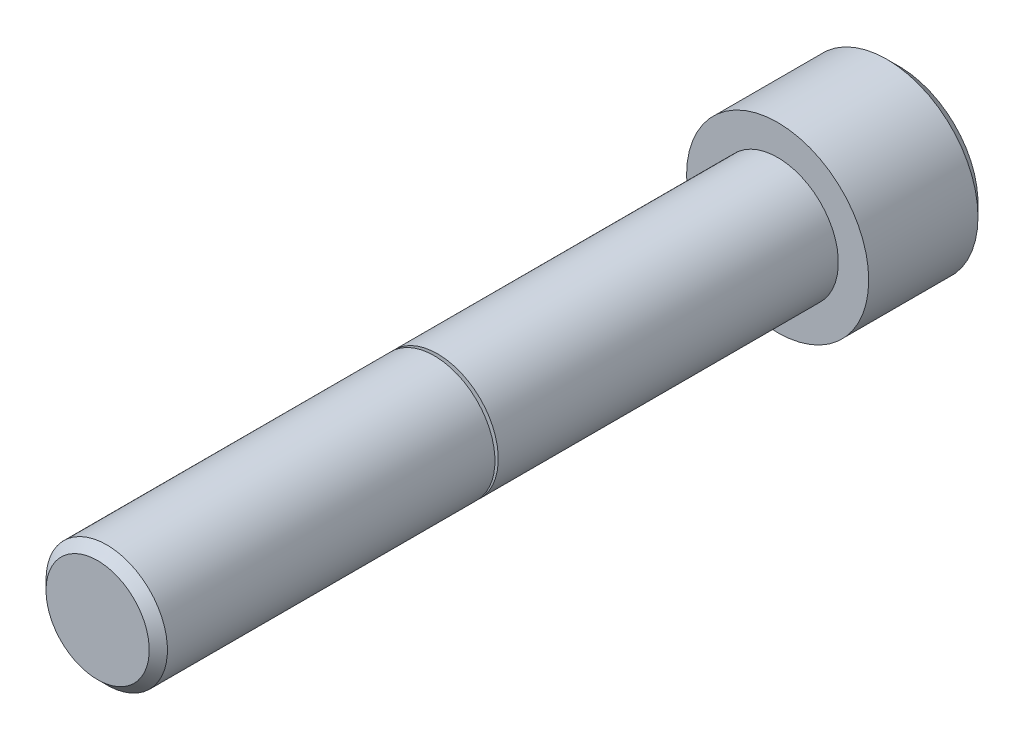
ISO-10303-21;
HEADER;
FILE_DESCRIPTION(('STEP AP214'),'2;1');
FILE_NAME('part.step','',(''),(''),'','','');
FILE_SCHEMA(('AUTOMOTIVE_DESIGN { 1 0 10303 214 1 1 1 1 }'));
ENDSEC;
DATA;
#1=APPLICATION_CONTEXT('core data for automotive mechanical design processes');
#2=APPLICATION_PROTOCOL_DEFINITION('international standard','automotive_design',2000,#1);
#3=PRODUCT_CONTEXT('',#1,'mechanical');
#4=PRODUCT('Part','Part','',(#3));
#5=PRODUCT_RELATED_PRODUCT_CATEGORY('part','',(#4));
#6=PRODUCT_DEFINITION_FORMATION('','',#4);
#7=PRODUCT_DEFINITION_CONTEXT('part definition',#1,'design');
#8=PRODUCT_DEFINITION('design','',#6,#7);
#9=PRODUCT_DEFINITION_SHAPE('','',#8);
#10=(LENGTH_UNIT() NAMED_UNIT(*) SI_UNIT(.MILLI.,.METRE.));
#11=(NAMED_UNIT(*) PLANE_ANGLE_UNIT() SI_UNIT($,.RADIAN.));
#12=(NAMED_UNIT(*) SI_UNIT($,.STERADIAN.) SOLID_ANGLE_UNIT());
#13=UNCERTAINTY_MEASURE_WITH_UNIT(LENGTH_MEASURE(1.E-05),#10,'distance_accuracy_value','');
#14=(GEOMETRIC_REPRESENTATION_CONTEXT(3) GLOBAL_UNCERTAINTY_ASSIGNED_CONTEXT((#13)) GLOBAL_UNIT_ASSIGNED_CONTEXT((#10,
#11,#12)) REPRESENTATION_CONTEXT('',''));
#15=CARTESIAN_POINT('',(0.,0.,0.));
#16=DIRECTION('',(0.,0.,1.));
#17=DIRECTION('',(1.,0.,0.));
#18=AXIS2_PLACEMENT_3D('',#15,#16,#17);
#19=CARTESIAN_POINT('',(0.,0.,-15.875));
#20=DIRECTION('',(0.,0.,1.));
#21=DIRECTION('',(1.,0.,0.));
#22=AXIS2_PLACEMENT_3D('',#19,#20,#21);
#23=PLANE('',#22);
#24=DIRECTION('',(-0.5,-0.866025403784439,0.));
#25=VECTOR('',#24,1.);
#26=CARTESIAN_POINT('',(7.33234841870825,0.,-15.875));
#27=LINE('',#26,#25);
#28=CARTESIAN_POINT('',(7.33234841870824,0.,-15.875));
#29=VERTEX_POINT('',#28);
#30=CARTESIAN_POINT('',(3.66617420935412,-6.35,-15.875));
#31=VERTEX_POINT('',#30);
#32=EDGE_CURVE('E147',#29,#31,#27,.T.);
#33=ORIENTED_EDGE('',*,*,#32,.F.);
#34=DIRECTION('',(0.5,-0.866025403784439,0.));
#35=VECTOR('',#34,1.);
#36=CARTESIAN_POINT('',(3.66617420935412,6.35,-15.875));
#37=LINE('',#36,#35);
#38=CARTESIAN_POINT('',(3.66617420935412,6.35,-15.875));
#39=VERTEX_POINT('',#38);
#40=EDGE_CURVE('E66',#39,#29,#37,.T.);
#41=ORIENTED_EDGE('',*,*,#40,.F.);
#42=DIRECTION('',(1.,0.,0.));
#43=VECTOR('',#42,1.);
#44=CARTESIAN_POINT('',(-3.66617420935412,6.35,-15.875));
#45=LINE('',#44,#43);
#46=CARTESIAN_POINT('',(-3.66617420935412,6.35,-15.875));
#47=VERTEX_POINT('',#46);
#48=EDGE_CURVE('E160',#47,#39,#45,.T.);
#49=ORIENTED_EDGE('',*,*,#48,.F.);
#50=DIRECTION('',(0.5,0.866025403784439,0.));
#51=VECTOR('',#50,1.);
#52=CARTESIAN_POINT('',(-7.33234841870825,0.,-15.875));
#53=LINE('',#52,#51);
#54=CARTESIAN_POINT('',(-7.33234841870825,0.,-15.875));
#55=VERTEX_POINT('',#54);
#56=EDGE_CURVE('E157',#55,#47,#53,.T.);
#57=ORIENTED_EDGE('',*,*,#56,.F.);
#58=DIRECTION('',(-0.5,0.866025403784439,0.));
#59=VECTOR('',#58,1.);
#60=CARTESIAN_POINT('',(-3.66617420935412,-6.35,-15.875));
#61=LINE('',#60,#59);
#62=CARTESIAN_POINT('',(-3.66617420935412,-6.35,-15.875));
#63=VERTEX_POINT('',#62);
#64=EDGE_CURVE('E114',#63,#55,#61,.T.);
#65=ORIENTED_EDGE('',*,*,#64,.F.);
#66=DIRECTION('',(-1.,0.,0.));
#67=VECTOR('',#66,1.);
#68=CARTESIAN_POINT('',(3.66617420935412,-6.35,-15.875));
#69=LINE('',#68,#67);
#70=EDGE_CURVE('E151',#31,#63,#69,.T.);
#71=ORIENTED_EDGE('',*,*,#70,.F.);
#72=EDGE_LOOP('',(#33,#41,#49,#57,#65,#71));
#73=FACE_BOUND('',#72,.T.);
#74=CARTESIAN_POINT('',(0.,0.,-15.875));
#75=DIRECTION('',(0.,0.,-1.));
#76=DIRECTION('',(-1.,0.,0.));
#77=AXIS2_PLACEMENT_3D('',#74,#75,#76);
#78=CIRCLE('',#77,10.31875);
#79=CARTESIAN_POINT('',(-10.31875,0.,-15.875));
#80=VERTEX_POINT('',#79);
#81=EDGE_CURVE('E166',#80,#80,#78,.T.);
#82=ORIENTED_EDGE('',*,*,#81,.T.);
#83=EDGE_LOOP('',(#82));
#84=FACE_BOUND('',#83,.T.);
#85=ADVANCED_FACE('F51',(#73,#84),#23,.F.);
#86=CARTESIAN_POINT('',(-6.74751000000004,0.,88.9));
#87=DIRECTION('',(0.,0.,-1.));
#88=DIRECTION('',(-1.,0.,0.));
#89=AXIS2_PLACEMENT_3D('',#86,#87,#88);
#90=PLANE('',#89);
#91=CARTESIAN_POINT('',(0.,0.,88.9));
#92=DIRECTION('',(0.,0.,-1.));
#93=DIRECTION('',(-1.,0.,0.));
#94=AXIS2_PLACEMENT_3D('',#91,#92,#93);
#95=CIRCLE('',#94,6.74751000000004);
#96=CARTESIAN_POINT('',(-6.74751000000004,0.,88.9));
#97=VERTEX_POINT('',#96);
#98=EDGE_CURVE('E11',#97,#97,#95,.T.);
#99=ORIENTED_EDGE('',*,*,#98,.F.);
#100=EDGE_LOOP('',(#99));
#101=FACE_BOUND('',#100,.T.);
#102=ADVANCED_FACE('F216',(#101),#90,.F.);
#103=CARTESIAN_POINT('',(0.,0.,88.9));
#104=DIRECTION('',(0.,0.,-1.));
#105=DIRECTION('',(-1.,0.,0.));
#106=AXIS2_PLACEMENT_3D('',#103,#104,#105);
#107=CONICAL_SURFACE('',#106,6.74751000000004,0.785398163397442);
#108=CARTESIAN_POINT('',(0.,0.,87.71001));
#109=DIRECTION('',(0.,0.,-1.));
#110=DIRECTION('',(-1.,0.,0.));
#111=AXIS2_PLACEMENT_3D('',#108,#109,#110);
#112=CIRCLE('',#111,7.93750000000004);
#113=CARTESIAN_POINT('',(-7.93750000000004,0.,87.71001));
#114=VERTEX_POINT('',#113);
#115=EDGE_CURVE('E59',#114,#114,#112,.T.);
#116=ORIENTED_EDGE('',*,*,#115,.F.);
#117=EDGE_LOOP('',(#116));
#118=FACE_BOUND('',#117,.T.);
#119=ORIENTED_EDGE('',*,*,#98,.T.);
#120=EDGE_LOOP('',(#119));
#121=FACE_BOUND('',#120,.T.);
#122=ADVANCED_FACE('F213',(#118,#121),#107,.T.);
#123=CARTESIAN_POINT('',(0.,0.,-10.585154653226));
#124=DIRECTION('',(0.,0.,-1.));
#125=DIRECTION('',(-1.,0.,0.));
#126=AXIS2_PLACEMENT_3D('',#123,#124,#125);
#127=CYLINDRICAL_SURFACE('',#126,7.93750000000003);
#128=CARTESIAN_POINT('',(0.,0.,44.8931209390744));
#129=DIRECTION('',(0.,0.,-1.));
#130=DIRECTION('',(-1.,0.,0.));
#131=AXIS2_PLACEMENT_3D('',#128,#129,#130);
#132=CIRCLE('',#131,7.93750000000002);
#133=CARTESIAN_POINT('',(-7.93750000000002,0.,44.8931209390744));
#134=VERTEX_POINT('',#133);
#135=EDGE_CURVE('E203',#134,#134,#132,.T.);
#136=ORIENTED_EDGE('',*,*,#135,.F.);
#137=EDGE_LOOP('',(#136));
#138=FACE_BOUND('',#137,.T.);
#139=ORIENTED_EDGE('',*,*,#115,.T.);
#140=EDGE_LOOP('',(#139));
#141=FACE_BOUND('',#140,.T.);
#142=ADVANCED_FACE('F211',(#138,#141),#127,.T.);
#143=CARTESIAN_POINT('',(0.,0.,44.8931209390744));
#144=DIRECTION('',(0.,0.,1.));
#145=DIRECTION('',(1.,0.,0.));
#146=AXIS2_PLACEMENT_3D('',#143,#144,#145);
#147=CONICAL_SURFACE('',#146,7.93750000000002,1.22173047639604);
#148=CARTESIAN_POINT('',(0.,0.,44.4987938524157));
#149=DIRECTION('',(0.,0.,-1.));
#150=DIRECTION('',(-1.,0.,0.));
#151=AXIS2_PLACEMENT_3D('',#148,#149,#150);
#152=CIRCLE('',#151,6.85409523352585);
#153=CARTESIAN_POINT('',(-6.85409523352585,0.,44.4987938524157));
#154=VERTEX_POINT('',#153);
#155=EDGE_CURVE('E199',#154,#154,#152,.T.);
#156=ORIENTED_EDGE('',*,*,#155,.F.);
#157=EDGE_LOOP('',(#156));
#158=FACE_BOUND('',#157,.T.);
#159=ORIENTED_EDGE('',*,*,#135,.T.);
#160=EDGE_LOOP('',(#159));
#161=FACE_BOUND('',#160,.T.);
#162=ADVANCED_FACE('F228',(#158,#161),#147,.T.);
#163=CARTESIAN_POINT('',(0.,0.,44.48));
#164=DIRECTION('',(0.,0.,-1.));
#165=DIRECTION('',(-1.,0.,0.));
#166=AXIS2_PLACEMENT_3D('',#163,#164,#165);
#167=TOROIDAL_SURFACE('',#166,6.86093563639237,0.0199999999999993);
#168=CARTESIAN_POINT('',(0.,0.,44.46));
#169=DIRECTION('',(0.,0.,-1.));
#170=DIRECTION('',(-1.,0.,0.));
#171=AXIS2_PLACEMENT_3D('',#168,#169,#170);
#172=CIRCLE('',#171,6.86093563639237);
#173=CARTESIAN_POINT('',(-6.86093563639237,0.,44.46));
#174=VERTEX_POINT('',#173);
#175=EDGE_CURVE('E195',#174,#174,#172,.T.);
#176=ORIENTED_EDGE('',*,*,#175,.F.);
#177=EDGE_LOOP('',(#176));
#178=FACE_BOUND('',#177,.T.);
#179=ORIENTED_EDGE('',*,*,#155,.T.);
#180=EDGE_LOOP('',(#179));
#181=FACE_BOUND('',#180,.T.);
#182=ADVANCED_FACE('F232',(#178,#181),#167,.F.);
#183=CARTESIAN_POINT('',(-7.93750000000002,0.,44.46));
#184=DIRECTION('',(0.,0.,-1.));
#185=DIRECTION('',(-1.,0.,0.));
#186=AXIS2_PLACEMENT_3D('',#183,#184,#185);
#187=PLANE('',#186);
#188=CARTESIAN_POINT('',(0.,0.,44.46));
#189=DIRECTION('',(0.,0.,-1.));
#190=DIRECTION('',(-1.,0.,0.));
#191=AXIS2_PLACEMENT_3D('',#188,#189,#190);
#192=CIRCLE('',#191,7.93750000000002);
#193=CARTESIAN_POINT('',(-7.93750000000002,0.,44.46));
#194=VERTEX_POINT('',#193);
#195=EDGE_CURVE('E191',#194,#194,#192,.T.);
#196=ORIENTED_EDGE('',*,*,#195,.F.);
#197=EDGE_LOOP('',(#196));
#198=FACE_BOUND('',#197,.T.);
#199=ORIENTED_EDGE('',*,*,#175,.T.);
#200=EDGE_LOOP('',(#199));
#201=FACE_BOUND('',#200,.T.);
#202=ADVANCED_FACE('F236',(#198,#201),#187,.F.);
#203=CARTESIAN_POINT('',(0.,0.,-10.585154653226));
#204=DIRECTION('',(0.,0.,-1.));
#205=DIRECTION('',(-1.,0.,0.));
#206=AXIS2_PLACEMENT_3D('',#203,#204,#205);
#207=CYLINDRICAL_SURFACE('',#206,7.93750000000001);
#208=CARTESIAN_POINT('',(0.,0.,0.));
#209=DIRECTION('',(0.,0.,-1.));
#210=DIRECTION('',(-1.,0.,0.));
#211=AXIS2_PLACEMENT_3D('',#208,#209,#210);
#212=CIRCLE('',#211,7.9375);
#213=CARTESIAN_POINT('',(-7.9375,0.,0.));
#214=VERTEX_POINT('',#213);
#215=EDGE_CURVE('E187',#214,#214,#212,.T.);
#216=ORIENTED_EDGE('',*,*,#215,.F.);
#217=EDGE_LOOP('',(#216));
#218=FACE_BOUND('',#217,.T.);
#219=ORIENTED_EDGE('',*,*,#195,.T.);
#220=EDGE_LOOP('',(#219));
#221=FACE_BOUND('',#220,.T.);
#222=ADVANCED_FACE('F240',(#218,#221),#207,.T.);
#223=CARTESIAN_POINT('',(-11.90625,0.,0.));
#224=DIRECTION('',(0.,0.,-1.));
#225=DIRECTION('',(-1.,0.,0.));
#226=AXIS2_PLACEMENT_3D('',#223,#224,#225);
#227=PLANE('',#226);
#228=CARTESIAN_POINT('',(0.,0.,0.));
#229=DIRECTION('',(0.,0.,-1.));
#230=DIRECTION('',(-1.,0.,0.));
#231=AXIS2_PLACEMENT_3D('',#228,#229,#230);
#232=CIRCLE('',#231,11.90625);
#233=CARTESIAN_POINT('',(-11.90625,0.,0.));
#234=VERTEX_POINT('',#233);
#235=EDGE_CURVE('E183',#234,#234,#232,.T.);
#236=ORIENTED_EDGE('',*,*,#235,.F.);
#237=EDGE_LOOP('',(#236));
#238=FACE_BOUND('',#237,.T.);
#239=ORIENTED_EDGE('',*,*,#215,.T.);
#240=EDGE_LOOP('',(#239));
#241=FACE_BOUND('',#240,.T.);
#242=ADVANCED_FACE('F244',(#238,#241),#227,.F.);
#243=CARTESIAN_POINT('',(0.,0.,-10.585154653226));
#244=DIRECTION('',(0.,0.,-1.));
#245=DIRECTION('',(-1.,0.,0.));
#246=AXIS2_PLACEMENT_3D('',#243,#244,#245);
#247=CYLINDRICAL_SURFACE('',#246,11.90625);
#248=CARTESIAN_POINT('',(0.,0.,-14.2875));
#249=DIRECTION('',(0.,0.,-1.));
#250=DIRECTION('',(-1.,0.,0.));
#251=AXIS2_PLACEMENT_3D('',#248,#249,#250);
#252=CIRCLE('',#251,11.90625);
#253=CARTESIAN_POINT('',(-11.90625,0.,-14.2875));
#254=VERTEX_POINT('',#253);
#255=EDGE_CURVE('E179',#254,#254,#252,.T.);
#256=ORIENTED_EDGE('',*,*,#255,.F.);
#257=EDGE_LOOP('',(#256));
#258=FACE_BOUND('',#257,.T.);
#259=ORIENTED_EDGE('',*,*,#235,.T.);
#260=EDGE_LOOP('',(#259));
#261=FACE_BOUND('',#260,.T.);
#262=ADVANCED_FACE('F248',(#258,#261),#247,.T.);
#263=CARTESIAN_POINT('',(0.,0.,-14.2875));
#264=DIRECTION('',(0.,0.,1.));
#265=DIRECTION('',(1.,0.,0.));
#266=AXIS2_PLACEMENT_3D('',#263,#264,#265);
#267=CONICAL_SURFACE('',#266,11.90625,0.785398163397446);
#268=ORIENTED_EDGE('',*,*,#81,.F.);
#269=EDGE_LOOP('',(#268));
#270=FACE_BOUND('',#269,.T.);
#271=ORIENTED_EDGE('',*,*,#255,.T.);
#272=EDGE_LOOP('',(#271));
#273=FACE_BOUND('',#272,.T.);
#274=ADVANCED_FACE('F252',(#270,#273),#267,.T.);
#275=CARTESIAN_POINT('',(3.66617420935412,6.35,-7.9375));
#276=DIRECTION('',(0.866025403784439,0.5,0.));
#277=DIRECTION('',(-0.5,0.866025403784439,0.));
#278=AXIS2_PLACEMENT_3D('',#275,#276,#277);
#279=PLANE('',#278);
#280=ORIENTED_EDGE('',*,*,#40,.T.);
#281=DIRECTION('',(0.,0.,-1.));
#282=VECTOR('',#281,1.);
#283=CARTESIAN_POINT('',(7.33234841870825,0.,-7.9375));
#284=LINE('',#283,#282);
#285=CARTESIAN_POINT('',(7.33234841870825,0.,-7.9375));
#286=VERTEX_POINT('',#285);
#287=EDGE_CURVE('E96',#286,#29,#284,.T.);
#288=ORIENTED_EDGE('',*,*,#287,.F.);
#289=DIRECTION('',(0.5,-0.866025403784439,0.));
#290=VECTOR('',#289,1.);
#291=CARTESIAN_POINT('',(3.66617420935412,6.35,-7.9375));
#292=LINE('',#291,#290);
#293=CARTESIAN_POINT('',(3.66617420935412,6.35,-7.9375));
#294=VERTEX_POINT('',#293);
#295=EDGE_CURVE('E163',#294,#286,#292,.T.);
#296=ORIENTED_EDGE('',*,*,#295,.F.);
#297=DIRECTION('',(0.,0.,-1.));
#298=VECTOR('',#297,1.);
#299=CARTESIAN_POINT('',(3.66617420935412,6.35,-7.9375));
#300=LINE('',#299,#298);
#301=EDGE_CURVE('E74',#294,#39,#300,.T.);
#302=ORIENTED_EDGE('',*,*,#301,.T.);
#303=EDGE_LOOP('',(#280,#288,#296,#302));
#304=FACE_BOUND('',#303,.T.);
#305=ADVANCED_FACE('F256',(#304),#279,.F.);
#306=CARTESIAN_POINT('',(-3.66617420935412,6.35,-7.9375));
#307=DIRECTION('',(0.,1.,0.));
#308=DIRECTION('',(-1.,0.,0.));
#309=AXIS2_PLACEMENT_3D('',#306,#307,#308);
#310=PLANE('',#309);
#311=ORIENTED_EDGE('',*,*,#48,.T.);
#312=ORIENTED_EDGE('',*,*,#301,.F.);
#313=DIRECTION('',(1.,0.,0.));
#314=VECTOR('',#313,1.);
#315=CARTESIAN_POINT('',(-3.66617420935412,6.35,-7.9375));
#316=LINE('',#315,#314);
#317=CARTESIAN_POINT('',(-3.66617420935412,6.35,-7.9375));
#318=VERTEX_POINT('',#317);
#319=EDGE_CURVE('E128',#318,#294,#316,.T.);
#320=ORIENTED_EDGE('',*,*,#319,.F.);
#321=DIRECTION('',(0.,0.,-1.));
#322=VECTOR('',#321,1.);
#323=CARTESIAN_POINT('',(-3.66617420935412,6.35,-7.9375));
#324=LINE('',#323,#322);
#325=EDGE_CURVE('E119',#318,#47,#324,.T.);
#326=ORIENTED_EDGE('',*,*,#325,.T.);
#327=EDGE_LOOP('',(#311,#312,#320,#326));
#328=FACE_BOUND('',#327,.T.);
#329=ADVANCED_FACE('F260',(#328),#310,.F.);
#330=CARTESIAN_POINT('',(-7.33234841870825,0.,-7.9375));
#331=DIRECTION('',(-0.866025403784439,0.5,0.));
#332=DIRECTION('',(-0.5,-0.866025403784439,0.));
#333=AXIS2_PLACEMENT_3D('',#330,#331,#332);
#334=PLANE('',#333);
#335=ORIENTED_EDGE('',*,*,#56,.T.);
#336=ORIENTED_EDGE('',*,*,#325,.F.);
#337=DIRECTION('',(0.5,0.866025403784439,0.));
#338=VECTOR('',#337,1.);
#339=CARTESIAN_POINT('',(-7.33234841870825,0.,-7.9375));
#340=LINE('',#339,#338);
#341=CARTESIAN_POINT('',(-7.33234841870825,0.,-7.9375));
#342=VERTEX_POINT('',#341);
#343=EDGE_CURVE('E123',#342,#318,#340,.T.);
#344=ORIENTED_EDGE('',*,*,#343,.F.);
#345=DIRECTION('',(0.,0.,-1.));
#346=VECTOR('',#345,1.);
#347=CARTESIAN_POINT('',(-7.33234841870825,0.,-7.9375));
#348=LINE('',#347,#346);
#349=EDGE_CURVE('E107',#342,#55,#348,.T.);
#350=ORIENTED_EDGE('',*,*,#349,.T.);
#351=EDGE_LOOP('',(#335,#336,#344,#350));
#352=FACE_BOUND('',#351,.T.);
#353=ADVANCED_FACE('F124',(#352),#334,.F.);
#354=CARTESIAN_POINT('',(-3.66617420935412,-6.35,-7.9375));
#355=DIRECTION('',(-0.866025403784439,-0.5,0.));
#356=DIRECTION('',(0.5,-0.866025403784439,0.));
#357=AXIS2_PLACEMENT_3D('',#354,#355,#356);
#358=PLANE('',#357);
#359=ORIENTED_EDGE('',*,*,#64,.T.);
#360=ORIENTED_EDGE('',*,*,#349,.F.);
#361=DIRECTION('',(-0.5,0.866025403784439,0.));
#362=VECTOR('',#361,1.);
#363=CARTESIAN_POINT('',(-3.66617420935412,-6.35,-7.9375));
#364=LINE('',#363,#362);
#365=CARTESIAN_POINT('',(-3.66617420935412,-6.35,-7.9375));
#366=VERTEX_POINT('',#365);
#367=EDGE_CURVE('E111',#366,#342,#364,.T.);
#368=ORIENTED_EDGE('',*,*,#367,.F.);
#369=DIRECTION('',(0.,0.,-1.));
#370=VECTOR('',#369,1.);
#371=CARTESIAN_POINT('',(-3.66617420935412,-6.35,-7.9375));
#372=LINE('',#371,#370);
#373=EDGE_CURVE('E120',#366,#63,#372,.T.);
#374=ORIENTED_EDGE('',*,*,#373,.T.);
#375=EDGE_LOOP('',(#359,#360,#368,#374));
#376=FACE_BOUND('',#375,.T.);
#377=ADVANCED_FACE('F109',(#376),#358,.F.);
#378=CARTESIAN_POINT('',(3.66617420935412,-6.35,-7.9375));
#379=DIRECTION('',(0.,-1.,0.));
#380=DIRECTION('',(1.,0.,0.));
#381=AXIS2_PLACEMENT_3D('',#378,#379,#380);
#382=PLANE('',#381);
#383=ORIENTED_EDGE('',*,*,#70,.T.);
#384=ORIENTED_EDGE('',*,*,#373,.F.);
#385=DIRECTION('',(-1.,0.,0.));
#386=VECTOR('',#385,1.);
#387=CARTESIAN_POINT('',(3.66617420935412,-6.35,-7.9375));
#388=LINE('',#387,#386);
#389=CARTESIAN_POINT('',(3.66617420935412,-6.35,-7.9375));
#390=VERTEX_POINT('',#389);
#391=EDGE_CURVE('E134',#390,#366,#388,.T.);
#392=ORIENTED_EDGE('',*,*,#391,.F.);
#393=DIRECTION('',(0.,0.,-1.));
#394=VECTOR('',#393,1.);
#395=CARTESIAN_POINT('',(3.66617420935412,-6.35,-7.9375));
#396=LINE('',#395,#394);
#397=EDGE_CURVE('E171',#390,#31,#396,.T.);
#398=ORIENTED_EDGE('',*,*,#397,.T.);
#399=EDGE_LOOP('',(#383,#384,#392,#398));
#400=FACE_BOUND('',#399,.T.);
#401=ADVANCED_FACE('F264',(#400),#382,.F.);
#402=CARTESIAN_POINT('',(7.33234841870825,0.,-7.9375));
#403=DIRECTION('',(0.866025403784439,-0.5,0.));
#404=DIRECTION('',(0.5,0.866025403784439,0.));
#405=AXIS2_PLACEMENT_3D('',#402,#403,#404);
#406=PLANE('',#405);
#407=ORIENTED_EDGE('',*,*,#32,.T.);
#408=ORIENTED_EDGE('',*,*,#397,.F.);
#409=DIRECTION('',(-0.5,-0.866025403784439,0.));
#410=VECTOR('',#409,1.);
#411=CARTESIAN_POINT('',(7.33234841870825,0.,-7.9375));
#412=LINE('',#411,#410);
#413=EDGE_CURVE('E139',#286,#390,#412,.T.);
#414=ORIENTED_EDGE('',*,*,#413,.F.);
#415=ORIENTED_EDGE('',*,*,#287,.T.);
#416=EDGE_LOOP('',(#407,#408,#414,#415));
#417=FACE_BOUND('',#416,.T.);
#418=ADVANCED_FACE('F261',(#417),#406,.F.);
#419=CARTESIAN_POINT('',(3.66617420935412,6.35,-7.9375));
#420=DIRECTION('',(0.,0.,1.));
#421=DIRECTION('',(1.,0.,0.));
#422=AXIS2_PLACEMENT_3D('',#419,#420,#421);
#423=PLANE('',#422);
#424=ORIENTED_EDGE('',*,*,#295,.T.);
#425=ORIENTED_EDGE('',*,*,#413,.T.);
#426=ORIENTED_EDGE('',*,*,#391,.T.);
#427=ORIENTED_EDGE('',*,*,#367,.T.);
#428=ORIENTED_EDGE('',*,*,#343,.T.);
#429=ORIENTED_EDGE('',*,*,#319,.T.);
#430=EDGE_LOOP('',(#424,#425,#426,#427,#428,#429));
#431=FACE_BOUND('',#430,.T.);
#432=ADVANCED_FACE('F131',(#431),#423,.F.);
#433=CLOSED_SHELL('',(#85,#102,#122,#142,#162,#182,#202,#222,#242,#262,#274,#305,#329,#353,#377,
#401,#418,#432));
#434=MANIFOLD_SOLID_BREP('B2',#433);
#435=ADVANCED_BREP_SHAPE_REPRESENTATION('',(#18,#434),#14);
#436=SHAPE_DEFINITION_REPRESENTATION(#9,#435);
ENDSEC;
END-ISO-10303-21;
